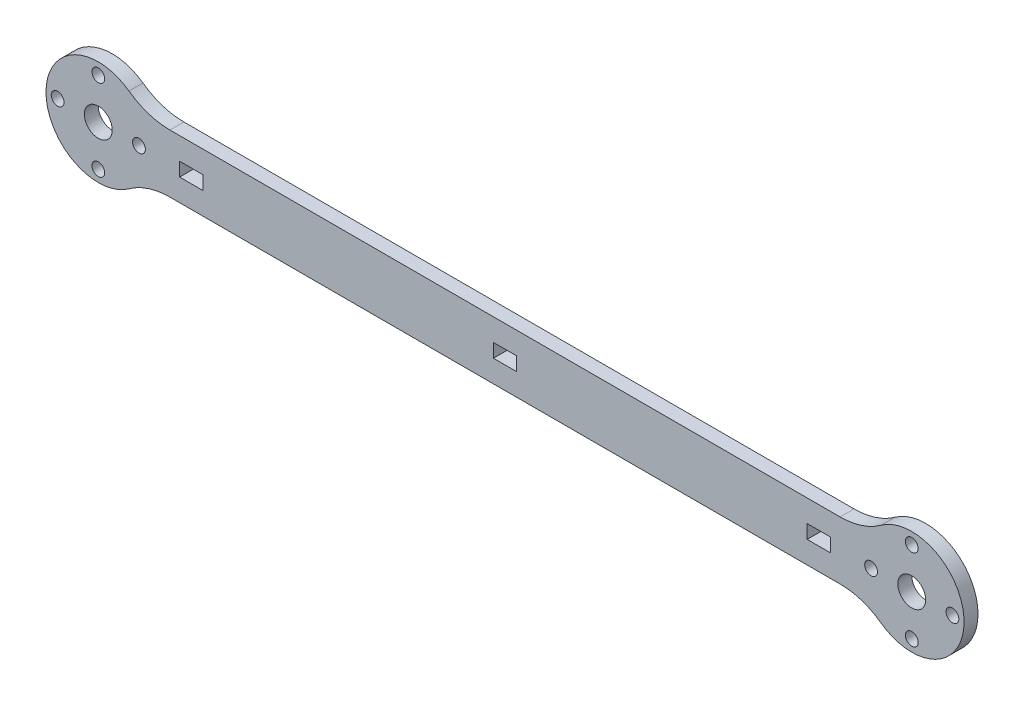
from build123d import *

# Parameters (mm, degrees)
SKETCH1_R           = 6
SKETCH1_R_2         = 2.75
SKETCH1_W           = 10
SKETCH1_H           = 5.9
BOSS_EXTRUDE1_DEPTH = 6


with BuildPart() as part:
    # Sketch1 → Boss-Extrude1 (new body)
    with BuildSketch(Plane.XY):
        with BuildLine():
            Line((-144.177929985, 12.5), (144.177929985, 12.5))
            ThreePointArc((144.177929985, 12.5), (153.436130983, 13.964308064), (161.790541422, 18.214285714))
            ThreePointArc((161.790541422, 18.214285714), (197.5, 0), (161.790541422, -18.214285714))
            ThreePointArc((161.790541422, -18.214285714), (153.436130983, -13.964308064), (144.177929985, -12.5))
            Line((144.177929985, -12.5), (-144.177929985, -12.5))
            ThreePointArc((-144.177929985, -12.5), (-153.436130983, -13.964308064), (-161.790541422, -18.214285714))
            ThreePointArc((-161.790541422, -18.214285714), (-197.5, 0), (-161.790541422, 18.214285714))
            ThreePointArc((-161.790541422, 18.214285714), (-153.436130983, 13.964308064), (-144.177929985, 12.5))
        make_face()
        with Locations((-175, 0)):
            Circle(SKETCH1_R, mode=Mode.SUBTRACT)
        with Locations((-175, 17.5)):
            Circle(SKETCH1_R_2, mode=Mode.SUBTRACT)
        with Locations((-157.5, 0)):
            Circle(SKETCH1_R_2, mode=Mode.SUBTRACT)
        with Locations((-175, -17.5)):
            Circle(SKETCH1_R_2, mode=Mode.SUBTRACT)
        with Locations((-192.5, 0)):
            Circle(SKETCH1_R_2, mode=Mode.SUBTRACT)
        with Locations(Location((175, -17.5, 0), (0, 0, 180))):
            Circle(SKETCH1_R_2, mode=Mode.SUBTRACT)
        with Locations(Location((192.5, 0, 0), (0, 0, 180))):
            Circle(SKETCH1_R_2, mode=Mode.SUBTRACT)
        with Locations(Location((157.5, 0, 0), (0, 0, 180))):
            Circle(SKETCH1_R_2, mode=Mode.SUBTRACT)
        with Locations(Location((175, 17.5, 0), (0, 0, 180))):
            Circle(SKETCH1_R_2, mode=Mode.SUBTRACT)
        with Locations((175, 0)):
            Circle(SKETCH1_R, mode=Mode.SUBTRACT)
        with Locations((135, 0)):
            Rectangle(SKETCH1_W, SKETCH1_H, mode=Mode.SUBTRACT)
        with Locations((-135, 0)):
            Rectangle(SKETCH1_W, SKETCH1_H, mode=Mode.SUBTRACT)
        Rectangle(SKETCH1_W, SKETCH1_H, mode=Mode.SUBTRACT)
    extrude(amount=BOSS_EXTRUDE1_DEPTH)


solid = part.part
